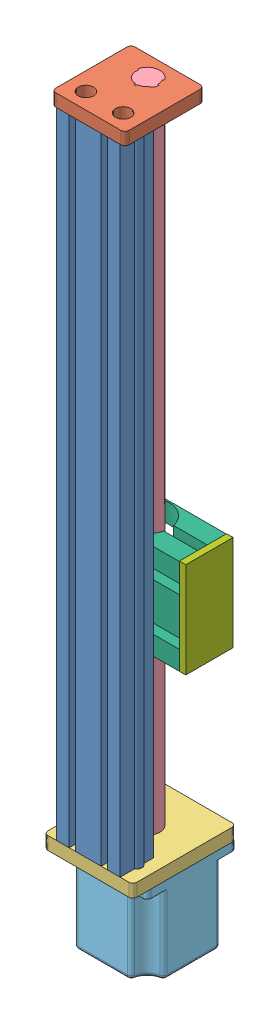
SolidWorks assembly 300mm Rail Assembly.SLDASM, configuration - (file format 12000). Lengths in mm.
Overall size (78.23 468.57 64.85).
8 component instances, 7 part files, 20 mates.
Components (placement in the parent):
- Base-2: Base.SLDPRT [-] at (-95.4137 -223.3019 406.9218) size (43.43 398.46 21.08)
- Free End-1: Free End.SLDPRT [-] at (-52.4877 183.0346 406.9218) x (-1 0 0) z (0 -1 0) size (45.97 49.78 7.87)
- Motor Mount-1: Motor Mount.SLDPRT [-] at (-103.4147 -223.3019 342.1518) x (1 0 0) z (0 -1 0) size (55.88 64.77 8.13)
- Ballscrew-1: Ballscrew.SLDPRT [-] at (-75.4747 183.0346 370.0156) x (-0.837169 0 -0.546944) z (0 -1 0) size (16 16 414.34)
- Motor-1: Motor.SLDPRT [-] at (-103.4147 -285.5319 397.9556) x (1 0 0) z (0 1 0) size (55.88 55.88 73.15)
- Carriage-1: Carriage.SLDPRT [-] at (-40.4227 -114.8038 384.8746) x (0 1 0) z (-1 0 0) size (59.69 29.72 70.1)
- Carriage End-1: Carriage End.SLDPRT [-] at (-40.4227 -114.8038 355.1566) x (0 1 0) z (1 0 0) size (59.94 29.72 4.06)
- Carriage End-3: Carriage End.SLDPRT [-] at (-110.5267 -54.8598 355.1566) x (0 -1 0) z (-1 0 0) size (59.94 29.72 4.06)
Mates (geometry in assembly coordinates):
- Coincident1: coincident anti-aligned: plane of Base-2 through (-94.1437 175.1606 394.9838) normal (0 1 0); plane of Free End-1 through (-52.4877 175.1606 406.9218) normal (0 -1 0)
- Parallel1: parallel aligned: plane of Base-2 through (-55.5357 175.1606 392.213) normal (1 0 0); plane of Free End-1
- Distance3: distance = 3.048 mm aligned: plane of Base-2 through (-95.4137 175.1606 392.213) normal (-1 0 0); plane of Free End-1
- Coincident6: coincident anti-aligned: plane of Base-2 through (-94.1437 -223.3019 394.9838) normal (0 -1 0); plane of Motor Mount-1 through (-103.4147 -223.3019 342.1518) normal (0 1 0)
- Coincident7: coincident aligned: plane of Base-2 through (-83.4757 175.1606 406.9218) normal (0 0 1); plane of Motor Mount-1 through (-103.4147 -231.4299 406.9218) normal (0 0 1)
- Distance4: distance = 8.001 mm aligned: plane of Base-2 through (-55.5357 175.1606 392.213) normal (1 0 0); plane of Motor Mount-1 through (-47.5347 -231.4299 342.1518) normal (1 0 0)
- Coincident10: coincident aligned: plane of Free End-1 through (-52.4877 183.0346 406.9218) normal (0 1 0); plane of Ballscrew-1 through (-75.4747 183.0346 370.0156) normal (0 1 0)
- Coincident11: coincident aligned: plane of Base-2 through (-83.4757 175.1606 406.9218) normal (0 0 1); plane of Free End-1 through (-52.4877 175.1606 406.9218) normal (0 0 1)
- Distance5: distance = 3.048 mm aligned: plane of Free End-1 through (-98.4617 175.1606 406.9218) normal (-1 0 0); plane of Base-2 through (-95.4137 175.1606 392.213) normal (-1 0 0)
- Concentric1: concentric anti-aligned: cylinder of Free End-1 through (-75.4747 183.0346 370.0156) axis (0 -1 0) radius 6.985; cylinder of Ballscrew-1 through (-75.4747 -231.3029 370.0156) axis (0 1 0) radius 8.001
- Coincident13: coincident anti-aligned: plane of Motor Mount-1 through (-103.4147 -231.4299 342.1518) normal (0 -1 0); plane of Motor-1 through (-103.4147 -231.4299 342.0756) normal (0 1 0)
- Concentric2: concentric anti-aligned: cylinder of Ballscrew-1 through (-75.4747 -231.3029 370.0156) axis (0 1 0) radius 8.001; cylinder of Motor-1 through (-75.4747 -212.3799 370.0156) axis (0 -1 0) radius 3.175
- Concentric4: concentric anti-aligned: cylinder of Ballscrew-1 through (-75.4747 -231.3029 370.0156) axis (0 1 0) radius 8.001; cylinder of Carriage-1 through (-75.4747 -55.1138 370.0156) axis (0 -1 0) radius 13.97
- Parallel4: parallel anti-aligned: plane of Base-2 through (-83.4757 175.1606 385.8398) normal (0 0 -1); plane of Carriage-1 through (-110.5267 -96.7698 384.8746) normal (0 0 1)
- Coincident15: coincident anti-aligned: plane of Carriage-1 through (-40.4227 -114.8038 384.8746) normal (1 0 0); plane of Carriage End-1 through (-40.4227 -114.8038 355.1566) normal (-1 0 0)
- Coincident16: coincident aligned: plane of Carriage-1 through (-110.5267 -96.7698 355.1566) normal (0 0 -1); plane of Carriage End-1 through (-36.3587 -114.8038 355.1566) normal (0 0 -1)
- Coincident17: coincident aligned: plane of Carriage-1 through (-110.5267 -114.8038 367.0946) normal (0 -1 0); plane of Carriage End-1 through (-36.3587 -114.8038 355.1566) normal (0 -1 0)
- Coincident18: coincident anti-aligned: plane of Carriage-1 through (-110.5267 -114.8038 384.8746) normal (-1 0 0); plane of Carriage End-3 through (-110.5267 -54.8598 355.1566) normal (1 0 0)
- Coincident19: coincident aligned: plane of Carriage-1 through (-110.5267 -96.7698 355.1566) normal (0 0 -1); plane of Carriage End-3 through (-114.5907 -54.8598 355.1566) normal (0 0 -1)
- Coincident20: coincident aligned: plane of Carriage-1 through (-110.5267 -114.8038 384.8746) normal (0 -1 0); plane of Carriage End-3 through (-114.5907 -114.8038 355.1566) normal (0 -1 0)
